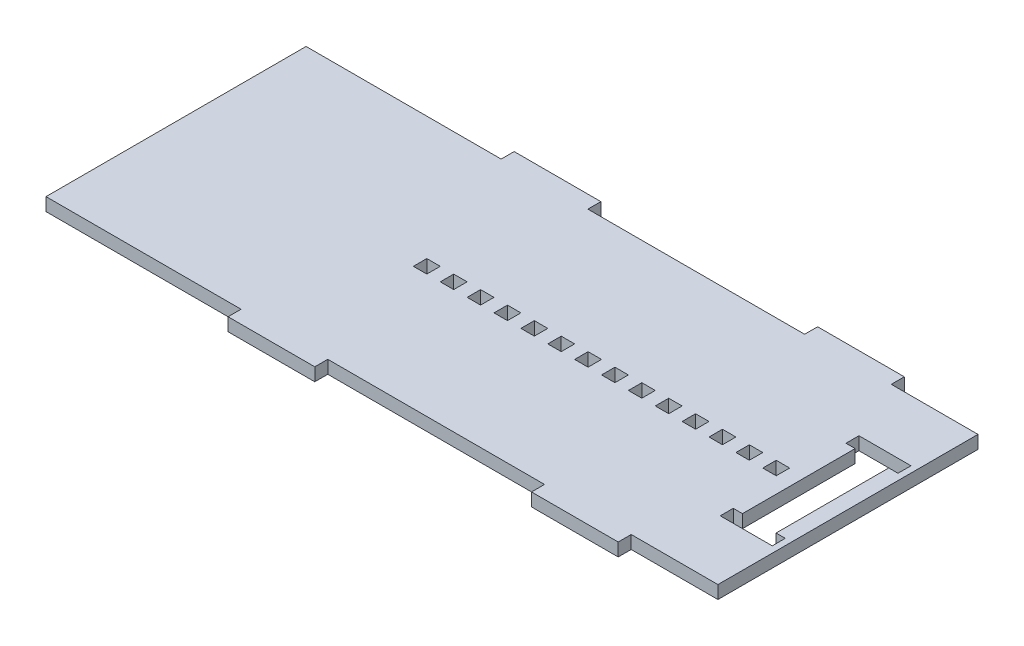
from build123d import *

# Parameters (mm, degrees)
SKETCH1_W           = 130
SKETCH1_H           = 60
BOSS_EXTRUDE1_DEPTH = 3
SKETCH2_W           = 20
SKETCH2_H           = 3
BOSS_EXTRUDE2_DEPTH = 3
SKETCH3_W           = 25
SKETCH3_H           = 60
BOSS_EXTRUDE3_DEPTH = 3
SKETCH4_W           = 3.1
SKETCH4_H           = 3.1
CUT_EXTRUDE1_DEPTH  = 10
SKETCH5_W           = 12
SKETCH5_H           = 3
CUT_EXTRUDE2_DEPTH  = 10
SKETCH6_W           = 7.746
SKETCH6_H           = 26
CUT_EXTRUDE3_DEPTH  = 10


with BuildPart() as part:
    # Sketch1 → Boss-Extrude1 (new body)
    with BuildSketch(Plane(origin=(0, 0, 0), x_dir=(1, 0, 0), z_dir=(0, 1, 0))):
        Rectangle(SKETCH1_W, SKETCH1_H)
    extrude(amount=BOSS_EXTRUDE1_DEPTH)

    # Sketch2 → Boss-Extrude2 (add)
    with BuildSketch(Plane(origin=(0, 0, 0), x_dir=(1, 0, 0), z_dir=(0, 1, 0))):
        with Locations((35, 31.5)):
            Rectangle(SKETCH2_W, SKETCH2_H)
        with Locations((-35, 31.5)):
            Rectangle(SKETCH2_W, SKETCH2_H)
        with Locations((-35, -31.5)):
            Rectangle(SKETCH2_W, SKETCH2_H)
        with Locations((35, -31.5)):
            Rectangle(SKETCH2_W, SKETCH2_H)
    extrude(amount=BOSS_EXTRUDE2_DEPTH)

    # Sketch3 → Boss-Extrude3 (add)
    with BuildSketch(Plane(origin=(0, 0, 0), x_dir=(1, 0, 0), z_dir=(0, 1, 0))):
        with Locations((-77.5, 0)):
            Rectangle(SKETCH3_W, SKETCH3_H)
    extrude(amount=BOSS_EXTRUDE3_DEPTH)

    # Sketch4 → Cut-Extrude1 (cut)
    with BuildSketch(Plane(origin=(0, 0, 0), x_dir=(1, 0, 0), z_dir=(0, 1, 0))):
        with Locations((42.25, 0)):
            Rectangle(SKETCH4_W, SKETCH4_H)
        with Locations((48.45, 0)):
            Rectangle(SKETCH4_W, SKETCH4_H)
        with Locations((36.05, 0)):
            Rectangle(SKETCH4_W, SKETCH4_H)
        with Locations((29.85, 0)):
            Rectangle(SKETCH4_W, SKETCH4_H)
        with Locations((23.65, 0)):
            Rectangle(SKETCH4_W, SKETCH4_H)
        with Locations((17.45, 0)):
            Rectangle(SKETCH4_W, SKETCH4_H)
        with Locations((11.25, 0)):
            Rectangle(SKETCH4_W, SKETCH4_H)
        with Locations((5.05, 0)):
            Rectangle(SKETCH4_W, SKETCH4_H)
        with Locations((-1.15, 0)):
            Rectangle(SKETCH4_W, SKETCH4_H)
        with Locations((-7.35, 0)):
            Rectangle(SKETCH4_W, SKETCH4_H)
        with Locations((-13.55, 0)):
            Rectangle(SKETCH4_W, SKETCH4_H)
        with Locations((-19.75, 0)):
            Rectangle(SKETCH4_W, SKETCH4_H)
        with Locations((-25.95, 0)):
            Rectangle(SKETCH4_W, SKETCH4_H)
        with Locations((-32.15, 0)):
            Rectangle(SKETCH4_W, SKETCH4_H)
    extrude(amount=CUT_EXTRUDE1_DEPTH, mode=Mode.SUBTRACT)

    # Sketch5 → Cut-Extrude2 (cut)
    with BuildSketch(Plane(origin=(0, 0, 0), x_dir=(1, 0, 0), z_dir=(0, 1, 0))):
        with Locations((57.54, 14.5)):
            Rectangle(SKETCH5_W, SKETCH5_H)
        with Locations((57.54, -14.5)):
            Rectangle(SKETCH5_W, SKETCH5_H)
    extrude(amount=CUT_EXTRUDE2_DEPTH, mode=Mode.SUBTRACT)

    # Sketch6 → Cut-Extrude3 (cut)
    with BuildSketch(Plane(origin=(0, 0, 0), x_dir=(1, 0, 0), z_dir=(0, 1, 0))):
        with Locations((57.54, 0)):
            Rectangle(SKETCH6_W, SKETCH6_H)
    extrude(amount=CUT_EXTRUDE3_DEPTH, mode=Mode.SUBTRACT)


solid = part.part
